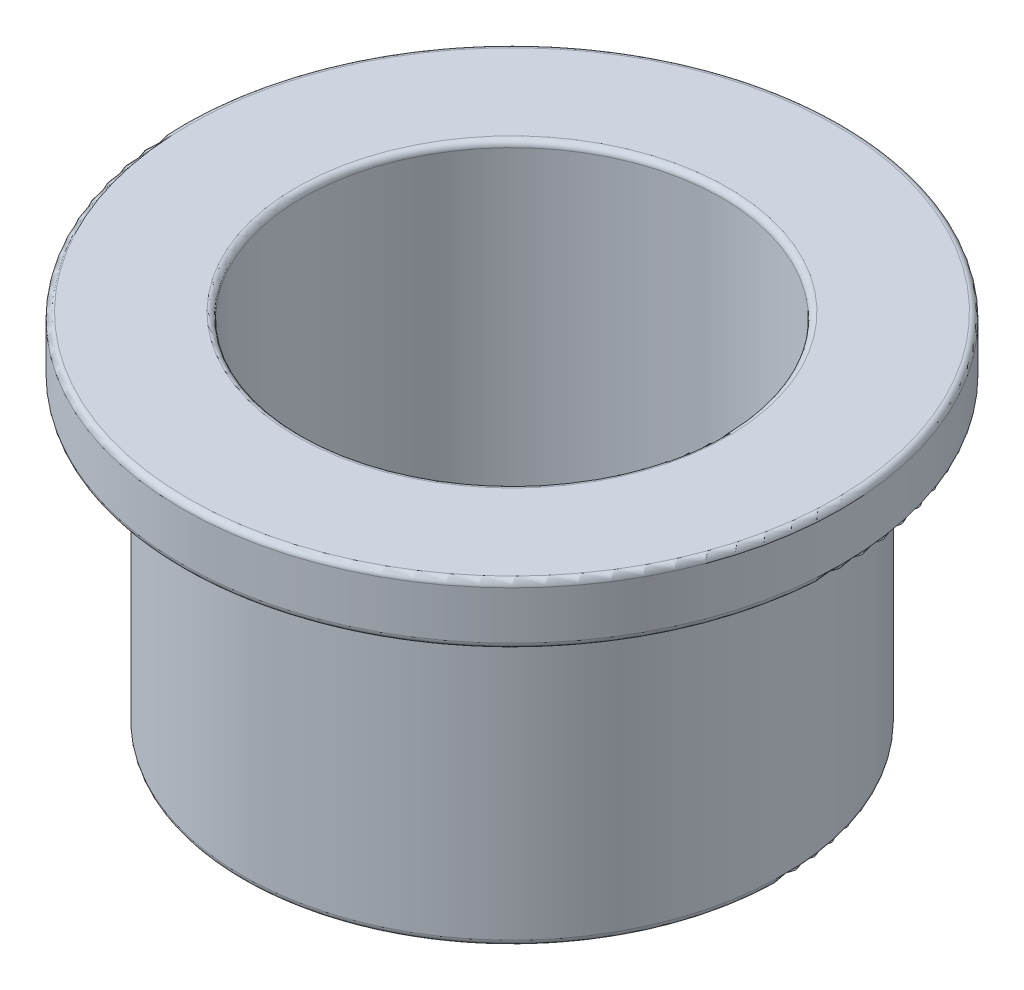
from build123d import *

# Parameters (mm, degrees)
CONG_1_R = 0.2


with BuildPart() as part:
    # Esquisse1 → R_volution1 (revolve)
    with BuildSketch(Plane.XY, mode=Mode.PRIVATE) as r_volution1_sk:
        Polygon((7, 0), (7, 12), (11, 12), (11, 10), (9, 10), (9, 0), align=None)
    revolve(r_volution1_sk.sketch.rotate(Axis((0, 0, 0), (0, 1, 0)), 90), axis=Axis((0, 0, 0), (0, 1, 0)))

    # Cong_1
    cong_1_edges = [part.edges().sort_by_distance(p)[0] for p in [
        (0, 0, 9),
        (0, 10, 9),
        (0, 10, 11),
        (0, 12, 11),
        (0, 12, 7),
        (0, 0, 7),
    ]]
    fillet(cong_1_edges, radius=CONG_1_R)


solid = part.part
